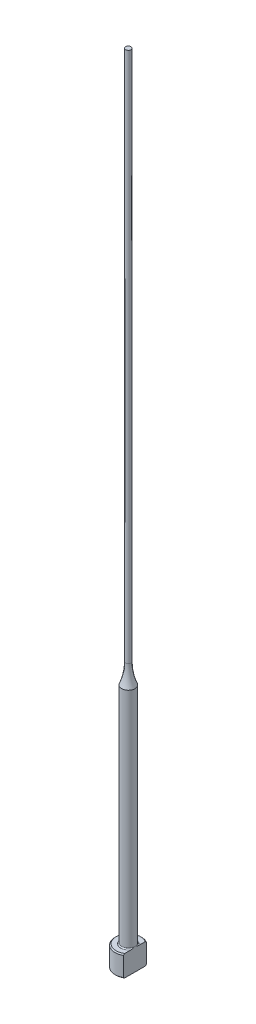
ISO-10303-21;
HEADER;
FILE_DESCRIPTION(('STEP AP214'),'2;1');
FILE_NAME('part.step','',(''),(''),'','','');
FILE_SCHEMA(('AUTOMOTIVE_DESIGN { 1 0 10303 214 1 1 1 1 }'));
ENDSEC;
DATA;
#1=APPLICATION_CONTEXT('core data for automotive mechanical design processes');
#2=APPLICATION_PROTOCOL_DEFINITION('international standard','automotive_design',2000,#1);
#3=PRODUCT_CONTEXT('',#1,'mechanical');
#4=PRODUCT('Part','Part','',(#3));
#5=PRODUCT_RELATED_PRODUCT_CATEGORY('part','',(#4));
#6=PRODUCT_DEFINITION_FORMATION('','',#4);
#7=PRODUCT_DEFINITION_CONTEXT('part definition',#1,'design');
#8=PRODUCT_DEFINITION('design','',#6,#7);
#9=PRODUCT_DEFINITION_SHAPE('','',#8);
#10=(LENGTH_UNIT() NAMED_UNIT(*) SI_UNIT(.MILLI.,.METRE.));
#11=(NAMED_UNIT(*) PLANE_ANGLE_UNIT() SI_UNIT($,.RADIAN.));
#12=(NAMED_UNIT(*) SI_UNIT($,.STERADIAN.) SOLID_ANGLE_UNIT());
#13=UNCERTAINTY_MEASURE_WITH_UNIT(LENGTH_MEASURE(1.E-05),#10,'distance_accuracy_value','');
#14=(GEOMETRIC_REPRESENTATION_CONTEXT(3) GLOBAL_UNCERTAINTY_ASSIGNED_CONTEXT((#13)) GLOBAL_UNIT_ASSIGNED_CONTEXT((#10,
#11,#12)) REPRESENTATION_CONTEXT('',''));
#15=CARTESIAN_POINT('',(0.,0.,0.));
#16=DIRECTION('',(0.,0.,1.));
#17=DIRECTION('',(1.,0.,0.));
#18=AXIS2_PLACEMENT_3D('',#15,#16,#17);
#19=CARTESIAN_POINT('',(-2.49999999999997,4.,0.));
#20=DIRECTION('',(0.,1.,0.));
#21=DIRECTION('',(0.,0.,1.));
#22=AXIS2_PLACEMENT_3D('',#19,#20,#21);
#23=PLANE('',#22);
#24=CARTESIAN_POINT('',(0.,4.,0.));
#25=DIRECTION('',(0.,1.,0.));
#26=DIRECTION('',(0.,0.,1.));
#27=AXIS2_PLACEMENT_3D('',#24,#25,#26);
#28=CIRCLE('',#27,2.29999999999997);
#29=CARTESIAN_POINT('',(1.24999999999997,4.,-1.93067345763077));
#30=VERTEX_POINT('',#29);
#31=CARTESIAN_POINT('',(1.24999999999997,4.,1.93067345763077));
#32=VERTEX_POINT('',#31);
#33=EDGE_CURVE('E187',#30,#32,#28,.T.);
#34=ORIENTED_EDGE('',*,*,#33,.T.);
#35=DIRECTION('',(0.,0.,-1.));
#36=VECTOR('',#35,1.);
#37=CARTESIAN_POINT('',(1.24999999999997,4.,0.));
#38=LINE('',#37,#36);
#39=CARTESIAN_POINT('',(1.24999999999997,3.99999999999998,0.734846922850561));
#40=VERTEX_POINT('',#39);
#41=EDGE_CURVE('E57',#32,#40,#38,.T.);
#42=ORIENTED_EDGE('',*,*,#41,.T.);
#43=CARTESIAN_POINT('',(0.,4.,0.));
#44=DIRECTION('',(0.,1.,0.));
#45=DIRECTION('',(0.,0.,1.));
#46=AXIS2_PLACEMENT_3D('',#43,#44,#45);
#47=CIRCLE('',#46,1.44999999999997);
#48=CARTESIAN_POINT('',(1.24999999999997,3.99999999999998,-0.734846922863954));
#49=VERTEX_POINT('',#48);
#50=EDGE_CURVE('E108',#40,#49,#47,.F.);
#51=ORIENTED_EDGE('',*,*,#50,.T.);
#52=EDGE_CURVE('E137',#49,#30,#38,.T.);
#53=ORIENTED_EDGE('',*,*,#52,.T.);
#54=EDGE_LOOP('',(#34,#42,#51,#53));
#55=FACE_BOUND('',#54,.T.);
#56=ADVANCED_FACE('F32',(#55),#23,.T.);
#57=CARTESIAN_POINT('',(0.,259.958771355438,0.));
#58=DIRECTION('',(0.,1.,0.));
#59=DIRECTION('',(0.,0.,1.));
#60=AXIS2_PLACEMENT_3D('',#57,#58,#59);
#61=CYLINDRICAL_SURFACE('',#60,2.49999999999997);
#62=CARTESIAN_POINT('',(0.,3.80000000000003,0.));
#63=DIRECTION('',(0.,1.,0.));
#64=DIRECTION('',(0.,0.,1.));
#65=AXIS2_PLACEMENT_3D('',#62,#63,#64);
#66=CIRCLE('',#65,2.49999999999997);
#67=CARTESIAN_POINT('',(1.24999999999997,3.80000000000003,2.16506350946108));
#68=VERTEX_POINT('',#67);
#69=CARTESIAN_POINT('',(1.24999999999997,3.80000000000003,-2.16506350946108));
#70=VERTEX_POINT('',#69);
#71=EDGE_CURVE('E105',#68,#70,#66,.F.);
#72=ORIENTED_EDGE('',*,*,#71,.T.);
#73=DIRECTION('',(0.,-1.,0.));
#74=VECTOR('',#73,1.);
#75=CARTESIAN_POINT('',(1.24999999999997,150.,-2.16506350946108));
#76=LINE('',#75,#74);
#77=CARTESIAN_POINT('',(1.24999999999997,0.199999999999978,-2.16506350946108));
#78=VERTEX_POINT('',#77);
#79=EDGE_CURVE('E193',#70,#78,#76,.T.);
#80=ORIENTED_EDGE('',*,*,#79,.T.);
#81=CARTESIAN_POINT('',(0.,0.199999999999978,0.));
#82=DIRECTION('',(0.,-1.,0.));
#83=DIRECTION('',(0.,0.,-1.));
#84=AXIS2_PLACEMENT_3D('',#81,#82,#83);
#85=CIRCLE('',#84,2.49999999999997);
#86=CARTESIAN_POINT('',(1.24999999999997,0.199999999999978,2.16506350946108));
#87=VERTEX_POINT('',#86);
#88=EDGE_CURVE('E100',#78,#87,#85,.F.);
#89=ORIENTED_EDGE('',*,*,#88,.T.);
#90=DIRECTION('',(0.,-1.,0.));
#91=VECTOR('',#90,1.);
#92=CARTESIAN_POINT('',(1.24999999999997,150.,2.16506350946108));
#93=LINE('',#92,#91);
#94=EDGE_CURVE('E93',#68,#87,#93,.T.);
#95=ORIENTED_EDGE('',*,*,#94,.F.);
#96=EDGE_LOOP('',(#72,#80,#89,#95));
#97=FACE_BOUND('',#96,.T.);
#98=ADVANCED_FACE('F158',(#97),#61,.T.);
#99=CARTESIAN_POINT('',(0.,0.,0.));
#100=DIRECTION('',(0.,-1.,0.));
#101=DIRECTION('',(0.,0.,-1.));
#102=AXIS2_PLACEMENT_3D('',#99,#100,#101);
#103=PLANE('',#102);
#104=CARTESIAN_POINT('',(0.,0.,0.));
#105=DIRECTION('',(0.,-1.,0.));
#106=DIRECTION('',(0.,0.,-1.));
#107=AXIS2_PLACEMENT_3D('',#104,#105,#106);
#108=CIRCLE('',#107,2.29999999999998);
#109=CARTESIAN_POINT('',(1.24999999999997,0.,1.93067345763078));
#110=VERTEX_POINT('',#109);
#111=CARTESIAN_POINT('',(1.24999999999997,0.,-1.93067345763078));
#112=VERTEX_POINT('',#111);
#113=EDGE_CURVE('E98',#110,#112,#108,.T.);
#114=ORIENTED_EDGE('',*,*,#113,.T.);
#115=DIRECTION('',(0.,0.,1.));
#116=VECTOR('',#115,1.);
#117=CARTESIAN_POINT('',(1.24999999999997,0.,2.16506350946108));
#118=LINE('',#117,#116);
#119=EDGE_CURVE('E83',#112,#110,#118,.T.);
#120=ORIENTED_EDGE('',*,*,#119,.T.);
#121=EDGE_LOOP('',(#114,#120));
#122=FACE_BOUND('',#121,.T.);
#123=ADVANCED_FACE('F103',(#122),#103,.T.);
#124=CARTESIAN_POINT('',(0.,4.,0.));
#125=DIRECTION('',(0.,-1.,0.));
#126=DIRECTION('',(0.,0.,-1.));
#127=AXIS2_PLACEMENT_3D('',#124,#125,#126);
#128=CONICAL_SURFACE('',#127,2.29999999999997,0.785398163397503);
#129=ORIENTED_EDGE('',*,*,#71,.F.);
#130=CARTESIAN_POINT('',(1.24999999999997,1.37269850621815,4.76610952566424));
#131=CARTESIAN_POINT('',(1.24999999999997,1.47721375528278,4.65805337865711));
#132=CARTESIAN_POINT('',(1.24999999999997,1.5816168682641,4.54988840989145));
#133=CARTESIAN_POINT('',(1.24999999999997,1.79013244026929,4.33327605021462));
#134=CARTESIAN_POINT('',(1.24999999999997,1.89424489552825,4.22482865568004));
#135=CARTESIAN_POINT('',(1.24999999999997,2.10216338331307,4.0075337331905));
#136=CARTESIAN_POINT('',(1.24999999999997,2.20596923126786,3.89868602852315));
#137=CARTESIAN_POINT('',(1.24999999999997,2.4131219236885,3.68055575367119));
#138=CARTESIAN_POINT('',(1.24999999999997,2.51646877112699,3.57127318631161));
#139=CARTESIAN_POINT('',(1.24999999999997,2.72052253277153,3.35432408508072));
#140=CARTESIAN_POINT('',(1.24999999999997,2.82124112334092,3.24666854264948));
#141=CARTESIAN_POINT('',(1.24999999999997,3.02192410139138,3.03065701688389));
#142=CARTESIAN_POINT('',(1.24999999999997,3.12188849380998,2.92230103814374));
#143=CARTESIAN_POINT('',(1.24999999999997,3.32077037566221,2.70467415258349));
#144=CARTESIAN_POINT('',(1.24999999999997,3.41968808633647,2.59540344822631));
#145=CARTESIAN_POINT('',(1.24999999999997,3.61608273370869,2.37557697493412));
#146=CARTESIAN_POINT('',(1.24999999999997,3.71355972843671,2.26502125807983));
#147=CARTESIAN_POINT('',(1.24999999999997,3.86911393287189,2.08515617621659));
#148=CARTESIAN_POINT('',(1.24999999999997,3.9278559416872,2.01642247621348));
#149=CARTESIAN_POINT('',(1.24999999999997,4.04429378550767,1.87806056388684));
#150=CARTESIAN_POINT('',(1.24999999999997,4.1019895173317,1.80843226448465));
#151=CARTESIAN_POINT('',(1.24999999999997,4.21658041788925,1.66728976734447));
#152=CARTESIAN_POINT('',(1.24999999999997,4.27346067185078,1.59576341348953));
#153=CARTESIAN_POINT('',(1.24999999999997,4.38522965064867,1.45118948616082));
#154=CARTESIAN_POINT('',(1.24999999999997,4.44011885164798,1.37814228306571));
#155=CARTESIAN_POINT('',(1.24999999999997,4.54788773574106,1.22886697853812));
#156=CARTESIAN_POINT('',(1.24999999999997,4.60072420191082,1.1526074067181));
#157=CARTESIAN_POINT('',(1.24999999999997,4.70212030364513,0.997098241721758));
#158=CARTESIAN_POINT('',(1.24999999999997,4.75067405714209,0.917844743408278));
#159=CARTESIAN_POINT('',(1.24999999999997,4.84043729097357,0.756494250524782));
#160=CARTESIAN_POINT('',(1.24999999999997,4.88173033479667,0.674444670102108));
#161=CARTESIAN_POINT('',(1.24999999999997,4.95366083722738,0.505835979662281));
#162=CARTESIAN_POINT('',(1.24999999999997,4.98433405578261,0.419293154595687));
#163=CARTESIAN_POINT('',(1.24999999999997,5.01753107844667,0.289507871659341));
#164=CARTESIAN_POINT('',(1.24999999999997,5.02633539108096,0.247870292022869));
#165=CARTESIAN_POINT('',(1.24999999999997,5.03997448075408,0.163937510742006));
#166=CARTESIAN_POINT('',(1.24999999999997,5.04480960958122,0.121642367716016));
#167=CARTESIAN_POINT('',(1.24999999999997,5.05016786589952,0.0369068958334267));
#168=CARTESIAN_POINT('',(1.24999999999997,5.05070431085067,-0.00553257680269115));
#169=CARTESIAN_POINT('',(1.24999999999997,5.04746162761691,-0.0902467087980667));
#170=CARTESIAN_POINT('',(1.24999999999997,5.04368214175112,-0.13252135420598));
#171=CARTESIAN_POINT('',(1.24999999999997,5.03212264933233,-0.216135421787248));
#172=CARTESIAN_POINT('',(1.24999999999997,5.02437758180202,-0.257479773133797));
#173=CARTESIAN_POINT('',(1.24999999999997,5.00536735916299,-0.339354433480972));
#174=CARTESIAN_POINT('',(1.24999999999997,4.99410082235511,-0.379884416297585));
#175=CARTESIAN_POINT('',(1.24999999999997,4.96852211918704,-0.460209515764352));
#176=CARTESIAN_POINT('',(1.24999999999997,4.95419322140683,-0.499999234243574));
#177=CARTESIAN_POINT('',(1.24999999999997,4.92306392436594,-0.578577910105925));
#178=CARTESIAN_POINT('',(1.24999999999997,4.90626403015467,-0.617367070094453));
#179=CARTESIAN_POINT('',(1.24999999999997,4.85269034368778,-0.73271994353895));
#180=CARTESIAN_POINT('',(1.24999999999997,4.81287978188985,-0.807869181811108));
#181=CARTESIAN_POINT('',(1.24999999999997,4.72799210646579,-0.955157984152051));
#182=CARTESIAN_POINT('',(1.24999999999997,4.68290855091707,-1.02729371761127));
#183=CARTESIAN_POINT('',(1.24999999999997,4.58903993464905,-1.16950551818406));
#184=CARTESIAN_POINT('',(1.24999999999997,4.54024093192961,-1.2395723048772));
#185=CARTESIAN_POINT('',(1.24999999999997,4.4402182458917,-1.37788366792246));
#186=CARTESIAN_POINT('',(1.24999999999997,4.38899576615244,-1.44612912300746));
#187=CARTESIAN_POINT('',(1.24999999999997,4.28411092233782,-1.58215279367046));
#188=CARTESIAN_POINT('',(1.24999999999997,4.23042529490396,-1.64991298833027));
#189=CARTESIAN_POINT('',(1.24999999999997,4.12172412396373,-1.78436052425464));
#190=CARTESIAN_POINT('',(1.24999999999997,4.06670849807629,-1.85104779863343));
#191=CARTESIAN_POINT('',(1.24999999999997,3.90044437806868,-2.04954410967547));
#192=CARTESIAN_POINT('',(1.24999999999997,3.78772044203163,-2.18011527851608));
#193=CARTESIAN_POINT('',(1.24999999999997,3.57927088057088,-2.41711311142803));
#194=CARTESIAN_POINT('',(1.24999999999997,3.48391557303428,-2.52386864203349));
#195=CARTESIAN_POINT('',(1.24999999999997,3.29202937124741,-2.73632311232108));
#196=CARTESIAN_POINT('',(1.24999999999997,3.19549844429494,-2.84202202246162));
#197=CARTESIAN_POINT('',(1.24999999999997,2.90446939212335,-3.15815976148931));
#198=CARTESIAN_POINT('',(1.24999999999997,2.70871394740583,-3.36743889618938));
#199=CARTESIAN_POINT('',(1.24999999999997,2.32338273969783,-3.77561196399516));
#200=CARTESIAN_POINT('',(1.24999999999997,2.13388401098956,-3.97457897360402));
#201=CARTESIAN_POINT('',(1.24999999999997,1.84887947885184,-4.27209258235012));
#202=CARTESIAN_POINT('',(1.24999999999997,1.75380504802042,-4.37105278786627));
#203=CARTESIAN_POINT('',(1.24999999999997,1.56341833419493,-4.56874260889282));
#204=CARTESIAN_POINT('',(1.24999999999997,1.46810605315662,-4.66747222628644));
#205=CARTESIAN_POINT('',(1.24999999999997,1.37269850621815,-4.76610952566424));
#206=B_SPLINE_CURVE_WITH_KNOTS('',3,(#130,#131,#132,#133,#134,#135,#136,#137,#138,#139,#140,
#141,#142,#143,#144,#145,#146,#147,#148,#149,#150,#151,#152,#153,#154,#155,#156,#157,#158,#159,
#160,#161,#162,#163,#164,#165,#166,#167,#168,#169,#170,#171,#172,#173,#174,#175,#176,#177,#178,
#179,#180,#181,#182,#183,#184,#185,#186,#187,#188,#189,#190,#191,#192,#193,#194,#195,#196,#197,
#198,#199,#200,#201,#202,#203,#204,#205),.UNSPECIFIED.,.F.,.F.,(4,2,2,2,2,2,2,2,2,2,2,2,2,2,2,2,
2,2,2,2,2,2,2,2,2,2,2,2,2,2,2,2,2,2,2,2,2,4),(0.,0.450994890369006,0.901995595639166,
1.35322763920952,1.80445675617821,2.24672733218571,2.68899501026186,3.13116725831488,
3.5733216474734,3.84456018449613,4.11582532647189,4.3899586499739,4.66402597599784,
4.94225842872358,5.22086725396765,5.49602313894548,5.77024327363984,5.89775644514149,
6.02525831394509,6.15236502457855,6.2794822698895,6.40549833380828,6.5315639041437,
6.6583367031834,6.78508362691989,7.03983854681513,7.29490801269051,7.55098686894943,
7.80693985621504,8.06626716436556,8.32561057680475,8.84304654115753,9.27246240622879,
9.7018902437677,10.5615524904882,11.3858525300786,11.797544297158,12.2092326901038),.UNSPECIFIED.);
#207=EDGE_CURVE('E136',#68,#32,#206,.T.);
#208=ORIENTED_EDGE('',*,*,#207,.T.);
#209=ORIENTED_EDGE('',*,*,#33,.F.);
#210=EDGE_CURVE('E128',#30,#70,#206,.T.);
#211=ORIENTED_EDGE('',*,*,#210,.T.);
#212=EDGE_LOOP('',(#129,#208,#209,#211));
#213=FACE_BOUND('',#212,.T.);
#214=ADVANCED_FACE('F144',(#213),#128,.T.);
#215=CARTESIAN_POINT('',(0.,0.199999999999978,0.));
#216=DIRECTION('',(0.,1.,0.));
#217=DIRECTION('',(0.,0.,1.));
#218=AXIS2_PLACEMENT_3D('',#215,#216,#217);
#219=CONICAL_SURFACE('',#218,2.49999999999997,0.785398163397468);
#220=ORIENTED_EDGE('',*,*,#88,.F.);
#221=CARTESIAN_POINT('',(1.24999999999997,2.62730149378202,-4.76610952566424));
#222=CARTESIAN_POINT('',(1.24999999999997,2.52278624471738,-4.65805337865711));
#223=CARTESIAN_POINT('',(1.24999999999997,2.41838313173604,-4.54988840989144));
#224=CARTESIAN_POINT('',(1.24999999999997,2.20986755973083,-4.3332760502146));
#225=CARTESIAN_POINT('',(1.24999999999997,2.10575510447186,-4.22482865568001));
#226=CARTESIAN_POINT('',(1.24999999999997,1.89783661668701,-4.00753373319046));
#227=CARTESIAN_POINT('',(1.24999999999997,1.79403076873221,-3.89868602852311));
#228=CARTESIAN_POINT('',(1.24999999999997,1.58687807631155,-3.68055575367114));
#229=CARTESIAN_POINT('',(1.24999999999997,1.48353122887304,-3.57127318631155));
#230=CARTESIAN_POINT('',(1.24999999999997,1.27947746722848,-3.35432408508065));
#231=CARTESIAN_POINT('',(1.24999999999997,1.17875887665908,-3.2466685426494));
#232=CARTESIAN_POINT('',(1.24999999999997,0.978075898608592,-3.0306570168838));
#233=CARTESIAN_POINT('',(1.24999999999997,0.878111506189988,-2.92230103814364));
#234=CARTESIAN_POINT('',(1.24999999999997,0.679229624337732,-2.70467415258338));
#235=CARTESIAN_POINT('',(1.24999999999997,0.580311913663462,-2.5954034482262));
#236=CARTESIAN_POINT('',(1.24999999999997,0.383917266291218,-2.375576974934));
#237=CARTESIAN_POINT('',(1.24999999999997,0.286440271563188,-2.2650212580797));
#238=CARTESIAN_POINT('',(1.24999999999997,0.130886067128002,-2.08515617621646));
#239=CARTESIAN_POINT('',(1.24999999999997,0.0721440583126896,-2.01642247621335));
#240=CARTESIAN_POINT('',(1.24999999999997,-0.0442937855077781,-1.87806056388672));
#241=CARTESIAN_POINT('',(1.24999999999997,-0.101989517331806,-1.80843226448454));
#242=CARTESIAN_POINT('',(1.24999999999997,-0.216580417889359,-1.66728976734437));
#243=CARTESIAN_POINT('',(1.24999999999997,-0.273460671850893,-1.59576341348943));
#244=CARTESIAN_POINT('',(1.24999999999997,-0.385229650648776,-1.45118948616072));
#245=CARTESIAN_POINT('',(1.24999999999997,-0.440118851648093,-1.37814228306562));
#246=CARTESIAN_POINT('',(1.24999999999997,-0.547887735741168,-1.22886697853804));
#247=CARTESIAN_POINT('',(1.24999999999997,-0.600724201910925,-1.15260740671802));
#248=CARTESIAN_POINT('',(1.24999999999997,-0.702120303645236,-0.99709824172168));
#249=CARTESIAN_POINT('',(1.24999999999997,-0.750674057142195,-0.917844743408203));
#250=CARTESIAN_POINT('',(1.24999999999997,-0.840437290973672,-0.756494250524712));
#251=CARTESIAN_POINT('',(1.24999999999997,-0.88173033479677,-0.67444467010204));
#252=CARTESIAN_POINT('',(1.24999999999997,-0.953660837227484,-0.505835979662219));
#253=CARTESIAN_POINT('',(1.24999999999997,-0.984334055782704,-0.419293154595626));
#254=CARTESIAN_POINT('',(1.24999999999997,-1.01753107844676,-0.289507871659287));
#255=CARTESIAN_POINT('',(1.24999999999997,-1.02633539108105,-0.247870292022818));
#256=CARTESIAN_POINT('',(1.24999999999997,-1.03997448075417,-0.163937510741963));
#257=CARTESIAN_POINT('',(1.24999999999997,-1.0448096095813,-0.121642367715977));
#258=CARTESIAN_POINT('',(1.24999999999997,-1.05016786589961,-0.0369068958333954));
#259=CARTESIAN_POINT('',(1.24999999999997,-1.05070431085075,0.00553257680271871));
#260=CARTESIAN_POINT('',(1.24999999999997,-1.04746162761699,0.0902467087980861));
#261=CARTESIAN_POINT('',(1.24999999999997,-1.0436821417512,0.132521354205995));
#262=CARTESIAN_POINT('',(1.24999999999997,-1.03212264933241,0.216135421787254));
#263=CARTESIAN_POINT('',(1.24999999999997,-1.0243775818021,0.257479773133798));
#264=CARTESIAN_POINT('',(1.24999999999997,-1.00536735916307,0.339354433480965));
#265=CARTESIAN_POINT('',(1.24999999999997,-0.994100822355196,0.379884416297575));
#266=CARTESIAN_POINT('',(1.24999999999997,-0.96852211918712,0.460209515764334));
#267=CARTESIAN_POINT('',(1.24999999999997,-0.95419322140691,0.499999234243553));
#268=CARTESIAN_POINT('',(1.24999999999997,-0.923063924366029,0.578577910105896));
#269=CARTESIAN_POINT('',(1.24999999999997,-0.906264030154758,0.617367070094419));
#270=CARTESIAN_POINT('',(1.24999999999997,-0.852690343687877,0.7327199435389));
#271=CARTESIAN_POINT('',(1.24999999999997,-0.812879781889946,0.807869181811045));
#272=CARTESIAN_POINT('',(1.24999999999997,-0.727992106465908,0.955157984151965));
#273=CARTESIAN_POINT('',(1.24999999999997,-0.682908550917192,1.02729371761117));
#274=CARTESIAN_POINT('',(1.24999999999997,-0.58903993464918,1.16950551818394));
#275=CARTESIAN_POINT('',(1.24999999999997,-0.540240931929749,1.23957230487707));
#276=CARTESIAN_POINT('',(1.24999999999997,-0.440218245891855,1.3778836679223));
#277=CARTESIAN_POINT('',(1.24999999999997,-0.3889957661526,1.44612912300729));
#278=CARTESIAN_POINT('',(1.24999999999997,-0.284110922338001,1.58215279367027));
#279=CARTESIAN_POINT('',(1.24999999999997,-0.230425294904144,1.64991298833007));
#280=CARTESIAN_POINT('',(1.24999999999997,-0.12172412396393,1.78436052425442));
#281=CARTESIAN_POINT('',(1.24999999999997,-0.0667084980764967,1.8510477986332));
#282=CARTESIAN_POINT('',(1.24999999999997,0.0995556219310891,2.0495441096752));
#283=CARTESIAN_POINT('',(1.24999999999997,0.212279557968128,2.18011527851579));
#284=CARTESIAN_POINT('',(1.24999999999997,0.420729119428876,2.41711311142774));
#285=CARTESIAN_POINT('',(1.24999999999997,0.516084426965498,2.52386864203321));
#286=CARTESIAN_POINT('',(1.24999999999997,0.707970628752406,2.73632311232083));
#287=CARTESIAN_POINT('',(1.24999999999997,0.804501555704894,2.84202202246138));
#288=CARTESIAN_POINT('',(1.24999999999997,1.09553060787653,3.15815976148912));
#289=CARTESIAN_POINT('',(1.24999999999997,1.29128605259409,3.36743889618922));
#290=CARTESIAN_POINT('',(1.24999999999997,1.67661726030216,3.77561196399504));
#291=CARTESIAN_POINT('',(1.24999999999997,1.86611598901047,3.97457897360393));
#292=CARTESIAN_POINT('',(1.24999999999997,2.15112052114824,4.27209258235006));
#293=CARTESIAN_POINT('',(1.24999999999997,2.24619495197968,4.37105278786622));
#294=CARTESIAN_POINT('',(1.24999999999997,2.43658166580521,4.5687426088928));
#295=CARTESIAN_POINT('',(1.24999999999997,2.53189394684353,4.66747222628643));
#296=CARTESIAN_POINT('',(1.24999999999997,2.62730149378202,4.76610952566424));
#297=B_SPLINE_CURVE_WITH_KNOTS('',3,(#221,#222,#223,#224,#225,#226,#227,#228,#229,#230,#231,
#232,#233,#234,#235,#236,#237,#238,#239,#240,#241,#242,#243,#244,#245,#246,#247,#248,#249,#250,
#251,#252,#253,#254,#255,#256,#257,#258,#259,#260,#261,#262,#263,#264,#265,#266,#267,#268,#269,
#270,#271,#272,#273,#274,#275,#276,#277,#278,#279,#280,#281,#282,#283,#284,#285,#286,#287,#288,
#289,#290,#291,#292,#293,#294,#295,#296),.UNSPECIFIED.,.F.,.F.,(4,2,2,2,2,2,2,2,2,2,2,2,2,2,2,2,
2,2,2,2,2,2,2,2,2,2,2,2,2,2,2,2,2,2,2,2,2,4),(0.,0.450994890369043,0.901995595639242,
1.35322763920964,1.80445675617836,2.2467273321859,2.68899501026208,3.13116725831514,
3.57332164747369,3.84456018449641,4.11582532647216,4.38995864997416,4.66402597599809,
4.94225842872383,5.22086725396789,5.49602313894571,5.77024327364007,5.89775644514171,
6.02525831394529,6.15236502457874,6.27948226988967,6.40549833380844,6.53156390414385,
6.65833670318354,6.78508362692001,7.03983854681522,7.29490801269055,7.55098686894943,
7.806939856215,8.06626716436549,8.32561057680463,8.84304654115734,9.27246240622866,
9.70189024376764,10.5615524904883,11.3858525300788,11.7975442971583,12.2092326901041),.UNSPECIFIED.);
#298=EDGE_CURVE('E86',#78,#112,#297,.T.);
#299=ORIENTED_EDGE('',*,*,#298,.T.);
#300=ORIENTED_EDGE('',*,*,#113,.F.);
#301=EDGE_CURVE('E89',#110,#87,#297,.T.);
#302=ORIENTED_EDGE('',*,*,#301,.T.);
#303=EDGE_LOOP('',(#220,#299,#300,#302));
#304=FACE_BOUND('',#303,.T.);
#305=ADVANCED_FACE('F97',(#304),#219,.T.);
#306=CARTESIAN_POINT('',(0.,4.19999999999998,0.));
#307=DIRECTION('',(0.,1.,0.));
#308=DIRECTION('',(0.,0.,1.));
#309=AXIS2_PLACEMENT_3D('',#306,#307,#308);
#310=TOROIDAL_SURFACE('',#309,1.44999999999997,0.2);
#311=CARTESIAN_POINT('',(1.24999999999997,4.19999999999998,0.));
#312=CARTESIAN_POINT('',(1.24999999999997,4.20000051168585,-1.97678914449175E-10));
#313=CARTESIAN_POINT('',(1.24999999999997,4.2000010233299,-1.0890806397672E-07));
#314=CARTESIAN_POINT('',(1.24999999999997,4.2000020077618,-4.52594762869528E-07));
#315=CARTESIAN_POINT('',(1.24999999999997,4.20000247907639,-6.90993038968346E-07));
#316=CARTESIAN_POINT('',(1.24999999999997,4.2000034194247,-1.26357943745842E-06));
#317=CARTESIAN_POINT('',(1.24999999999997,4.20000388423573,-1.6045761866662E-06));
#318=CARTESIAN_POINT('',(1.24999999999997,4.20000476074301,-2.33954900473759E-06));
#319=CARTESIAN_POINT('',(1.24999999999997,4.20000517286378,-2.73304148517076E-06));
#320=CARTESIAN_POINT('',(1.24999999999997,4.20000655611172,-4.1454401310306E-06));
#321=CARTESIAN_POINT('',(1.24999999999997,4.20000745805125,-5.23310092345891E-06));
#322=CARTESIAN_POINT('',(1.24999999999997,4.20000906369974,-7.47950361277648E-06));
#323=CARTESIAN_POINT('',(1.24999999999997,4.20000977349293,-8.63414438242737E-06));
#324=CARTESIAN_POINT('',(1.24999999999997,4.20001244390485,-1.31453477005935E-05));
#325=CARTESIAN_POINT('',(1.24999999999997,4.2000142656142,-1.65880555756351E-05));
#326=CARTESIAN_POINT('',(1.24999999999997,4.20001724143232,-2.33729029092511E-05));
#327=CARTESIAN_POINT('',(1.24999999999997,4.20001844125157,-2.669561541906E-05));
#328=CARTESIAN_POINT('',(1.24999999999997,4.20002354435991,-4.08635086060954E-05));
#329=CARTESIAN_POINT('',(1.24999999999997,4.2000274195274,-5.17114614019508E-05));
#330=CARTESIAN_POINT('',(1.24999999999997,4.2000336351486,-7.20057673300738E-05));
#331=CARTESIAN_POINT('',(1.24999999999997,4.2000361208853,-8.14057065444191E-05));
#332=CARTESIAN_POINT('',(1.24999999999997,4.20005581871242,-0.000149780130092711));
#333=CARTESIAN_POINT('',(1.24999999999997,4.20008094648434,-0.000206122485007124));
#334=CARTESIAN_POINT('',(1.24999999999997,4.2001750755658,-0.000425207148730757));
#335=CARTESIAN_POINT('',(1.24999999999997,4.20023819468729,-0.000589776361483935));
#336=CARTESIAN_POINT('',(1.24999999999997,4.20048692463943,-0.00122878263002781));
#337=CARTESIAN_POINT('',(1.24999999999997,4.20067870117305,-0.00170134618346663));
#338=CARTESIAN_POINT('',(1.24999999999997,4.20146022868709,-0.00363636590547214));
#339=CARTESIAN_POINT('',(1.24999999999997,4.2020429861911,-0.0051009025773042));
#340=CARTESIAN_POINT('',(1.24999999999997,4.20939719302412,-0.0235712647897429));
#341=CARTESIAN_POINT('',(1.24999999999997,4.21621259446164,-0.0405643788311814));
#342=CARTESIAN_POINT('',(1.24999999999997,4.22951000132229,-0.0739606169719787));
#343=CARTESIAN_POINT('',(1.24999999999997,4.23599508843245,-0.0903626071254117));
#344=CARTESIAN_POINT('',(1.24999999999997,4.24961430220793,-0.125111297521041));
#345=CARTESIAN_POINT('',(1.24999999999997,4.25673641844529,-0.14346280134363));
#346=CARTESIAN_POINT('',(1.24999999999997,4.27085039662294,-0.180427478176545));
#347=CARTESIAN_POINT('',(1.24999999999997,4.27784022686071,-0.199041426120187));
#348=CARTESIAN_POINT('',(1.24999999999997,4.29479134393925,-0.245221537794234));
#349=CARTESIAN_POINT('',(1.24999999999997,4.30459026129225,-0.272848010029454));
#350=CARTESIAN_POINT('',(1.24999999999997,4.32310234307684,-0.327738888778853));
#351=CARTESIAN_POINT('',(1.24999999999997,4.3318356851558,-0.354996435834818));
#352=CARTESIAN_POINT('',(1.24999999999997,4.34936561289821,-0.413744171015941));
#353=CARTESIAN_POINT('',(1.24999999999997,4.35799470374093,-0.445285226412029));
#354=CARTESIAN_POINT('',(1.24999999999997,4.37338463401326,-0.50909191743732));
#355=CARTESIAN_POINT('',(1.24999999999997,4.38013036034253,-0.541361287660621));
#356=CARTESIAN_POINT('',(1.24999999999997,4.39136059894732,-0.608339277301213));
#357=CARTESIAN_POINT('',(1.24999999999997,4.39568167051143,-0.643076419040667));
#358=CARTESIAN_POINT('',(1.24999999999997,4.40037605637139,-0.712733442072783));
#359=CARTESIAN_POINT('',(1.24999999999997,4.40076553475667,-0.747651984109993));
#360=CARTESIAN_POINT('',(1.24999999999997,4.39677668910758,-0.808103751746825));
#361=CARTESIAN_POINT('',(1.24999999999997,4.39361441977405,-0.833711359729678));
#362=CARTESIAN_POINT('',(1.24999999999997,4.38355990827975,-0.883915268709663));
#363=CARTESIAN_POINT('',(1.24999999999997,4.37671813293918,-0.908520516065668));
#364=CARTESIAN_POINT('',(1.24999999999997,4.36252570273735,-0.944879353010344));
#365=CARTESIAN_POINT('',(1.24999999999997,4.35688428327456,-0.957298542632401));
#366=CARTESIAN_POINT('',(1.24999999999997,4.34399066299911,-0.981318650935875));
#367=CARTESIAN_POINT('',(1.24999999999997,4.33673636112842,-0.992918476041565));
#368=CARTESIAN_POINT('',(1.24999999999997,4.32199744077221,-1.01267533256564));
#369=CARTESIAN_POINT('',(1.24999999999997,4.31482723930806,-1.02106482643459));
#370=CARTESIAN_POINT('',(1.24999999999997,4.29924321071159,-1.03659690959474));
#371=CARTESIAN_POINT('',(1.24999999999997,4.29083198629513,-1.04374204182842));
#372=CARTESIAN_POINT('',(1.24999999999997,4.27498600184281,-1.05478694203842));
#373=CARTESIAN_POINT('',(1.24999999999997,4.26780814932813,-1.059053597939));
#374=CARTESIAN_POINT('',(1.24999999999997,4.25284782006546,-1.06635953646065));
#375=CARTESIAN_POINT('',(1.24999999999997,4.24506572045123,-1.06939957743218));
#376=CARTESIAN_POINT('',(1.24999999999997,4.22901828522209,-1.07404931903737));
#377=CARTESIAN_POINT('',(1.24999999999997,4.22074990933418,-1.07564870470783));
#378=CARTESIAN_POINT('',(1.24999999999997,4.20405985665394,-1.07723717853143));
#379=CARTESIAN_POINT('',(1.24999999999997,4.19563825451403,-1.07722703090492));
#380=CARTESIAN_POINT('',(1.24999999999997,4.17988128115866,-1.07569157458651));
#381=CARTESIAN_POINT('',(1.24999999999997,4.17252879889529,-1.0743339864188));
#382=CARTESIAN_POINT('',(1.24999999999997,4.15814333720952,-1.07044616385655));
#383=CARTESIAN_POINT('',(1.24999999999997,4.15111040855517,-1.06791574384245));
#384=CARTESIAN_POINT('',(1.24999999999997,4.13724955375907,-1.06171920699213));
#385=CARTESIAN_POINT('',(1.24999999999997,4.13043935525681,-1.05801386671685));
#386=CARTESIAN_POINT('',(1.24999999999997,4.11740316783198,-1.04969609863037));
#387=CARTESIAN_POINT('',(1.24999999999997,4.11117742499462,-1.04508329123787));
#388=CARTESIAN_POINT('',(1.24999999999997,4.09586196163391,-1.03220341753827));
#389=CARTESIAN_POINT('',(1.24999999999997,4.08723799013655,-1.02338140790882));
#390=CARTESIAN_POINT('',(1.24999999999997,4.07148817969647,-1.00448021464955));
#391=CARTESIAN_POINT('',(1.24999999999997,4.0643671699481,-0.994397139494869));
#392=CARTESIAN_POINT('',(1.24999999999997,4.04800089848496,-0.967694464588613));
#393=CARTESIAN_POINT('',(1.24999999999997,4.0397014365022,-0.950498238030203));
#394=CARTESIAN_POINT('',(1.24999999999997,4.02582422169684,-0.915117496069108));
#395=CARTESIAN_POINT('',(1.24999999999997,4.02024415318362,-0.896933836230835));
#396=CARTESIAN_POINT('',(1.24999999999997,4.00805724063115,-0.84678106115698));
#397=CARTESIAN_POINT('',(1.24999999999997,4.00359525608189,-0.814297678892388));
#398=CARTESIAN_POINT('',(1.24999999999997,3.99933348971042,-0.748574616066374));
#399=CARTESIAN_POINT('',(1.24999999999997,3.99961552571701,-0.715331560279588));
#400=CARTESIAN_POINT('',(1.24999999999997,4.00446632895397,-0.637920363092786));
#401=CARTESIAN_POINT('',(1.24999999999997,4.0104488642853,-0.593849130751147));
#402=CARTESIAN_POINT('',(1.24999999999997,4.02681929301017,-0.506401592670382));
#403=CARTESIAN_POINT('',(1.24999999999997,4.03722697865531,-0.463029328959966));
#404=CARTESIAN_POINT('',(1.24999999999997,4.06007158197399,-0.380638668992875));
#405=CARTESIAN_POINT('',(1.24999999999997,4.07227412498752,-0.341553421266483));
#406=CARTESIAN_POINT('',(1.24999999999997,4.09824323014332,-0.264347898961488));
#407=CARTESIAN_POINT('',(1.24999999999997,4.11199311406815,-0.226221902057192));
#408=CARTESIAN_POINT('',(1.24999999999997,4.13108825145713,-0.17535053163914));
#409=CARTESIAN_POINT('',(1.24999999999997,4.13599999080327,-0.162438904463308));
#410=CARTESIAN_POINT('',(1.24999999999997,4.14604281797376,-0.13631825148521));
#411=CARTESIAN_POINT('',(1.24999999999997,4.15117629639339,-0.123110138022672));
#412=CARTESIAN_POINT('',(1.24999999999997,4.16341702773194,-0.0918425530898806));
#413=CARTESIAN_POINT('',(1.24999999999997,4.17055250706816,-0.0737943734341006));
#414=CARTESIAN_POINT('',(1.24999999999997,4.18426943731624,-0.039358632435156));
#415=CARTESIAN_POINT('',(1.24999999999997,4.19084281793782,-0.0229681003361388));
#416=CARTESIAN_POINT('',(1.24999999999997,4.1979556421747,-0.00510438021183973));
#417=CARTESIAN_POINT('',(1.24999999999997,4.19853702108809,-0.00364331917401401));
#418=CARTESIAN_POINT('',(1.24999999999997,4.19931818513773,-0.00170914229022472));
#419=CARTESIAN_POINT('',(1.24999999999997,4.19951102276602,-0.00123396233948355));
#420=CARTESIAN_POINT('',(1.24999999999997,4.19976104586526,-0.000591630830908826));
#421=CARTESIAN_POINT('',(1.24999999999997,4.19982443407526,-0.000426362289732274));
#422=CARTESIAN_POINT('',(1.24999999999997,4.19991892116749,-0.000206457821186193));
#423=CARTESIAN_POINT('',(1.24999999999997,4.19994410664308,-0.000149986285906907));
#424=CARTESIAN_POINT('',(1.24999999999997,4.19996383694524,-8.1464748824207E-05));
#425=CARTESIAN_POINT('',(1.24999999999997,4.1999663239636,-7.20551568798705E-05));
#426=CARTESIAN_POINT('',(1.24999999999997,4.19997254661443,-5.17396177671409E-05));
#427=CARTESIAN_POINT('',(1.24999999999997,4.19997642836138,-4.08803464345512E-05));
#428=CARTESIAN_POINT('',(1.24999999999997,4.19998153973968,-2.6699757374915E-05));
#429=CARTESIAN_POINT('',(1.24999999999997,4.19998274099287,-2.33755458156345E-05));
#430=CARTESIAN_POINT('',(1.24999999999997,4.19998572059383,-1.65878758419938E-05));
#431=CARTESIAN_POINT('',(1.24999999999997,4.1999875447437,-1.31438994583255E-05));
#432=CARTESIAN_POINT('',(1.24999999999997,4.19999021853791,-8.63150514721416E-06));
#433=CARTESIAN_POINT('',(1.24999999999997,4.19999092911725,-7.47674883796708E-06));
#434=CARTESIAN_POINT('',(1.24999999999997,4.19999253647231,-5.2302708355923E-06));
#435=CARTESIAN_POINT('',(1.24999999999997,4.19999343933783,-4.14265823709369E-06));
#436=CARTESIAN_POINT('',(1.24999999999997,4.19999482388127,-2.73051192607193E-06));
#437=CARTESIAN_POINT('',(1.24999999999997,4.19999523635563,-2.3371292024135E-06));
#438=CARTESIAN_POINT('',(1.24999999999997,4.19999611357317,-1.60243919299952E-06));
#439=CARTESIAN_POINT('',(1.24999999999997,4.199996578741,-1.26161621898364E-06));
#440=CARTESIAN_POINT('',(1.24999999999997,4.19999751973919,-6.89449600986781E-07));
#441=CARTESIAN_POINT('',(1.24999999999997,4.19999799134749,-4.51288705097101E-07));
#442=CARTESIAN_POINT('',(1.24999999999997,4.19999897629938,-1.08178112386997E-07));
#443=CARTESIAN_POINT('',(1.24999999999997,4.1999994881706,1.97734354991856E-10));
#444=CARTESIAN_POINT('',(1.24999999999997,4.19999999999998,0.));
#445=B_SPLINE_CURVE_WITH_KNOTS('',3,(#311,#312,#313,#314,#315,#316,#317,#318,#319,#320,#321,
#322,#323,#324,#325,#326,#327,#328,#329,#330,#331,#332,#333,#334,#335,#336,#337,#338,#339,#340,
#341,#342,#343,#344,#345,#346,#347,#348,#349,#350,#351,#352,#353,#354,#355,#356,#357,#358,#359,
#360,#361,#362,#363,#364,#365,#366,#367,#368,#369,#370,#371,#372,#373,#374,#375,#376,#377,#378,
#379,#380,#381,#382,#383,#384,#385,#386,#387,#388,#389,#390,#391,#392,#393,#394,#395,#396,#397,
#398,#399,#400,#401,#402,#403,#404,#405,#406,#407,#408,#409,#410,#411,#412,#413,#414,#415,#416,
#417,#418,#419,#420,#421,#422,#423,#424,#425,#426,#427,#428,#429,#430,#431,#432,#433,#434,#435,
#436,#437,#438,#439,#440,#441,#442,#443,#444),.UNSPECIFIED.,.T.,.F.,(4,2,2,2,2,2,2,2,2,2,2,2,2,
2,2,2,2,2,2,2,2,2,2,2,2,2,2,2,2,2,2,2,2,2,2,2,2,2,2,2,2,2,2,2,2,2,2,2,2,2,2,2,2,2,2,2,2,2,2,2,2,
2,2,2,2,2,4),(0.,1.5342757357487E-06,3.1111505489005E-06,4.83351634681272E-06,
6.54098944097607E-06,1.07594293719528E-05,1.48222851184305E-05,2.64707313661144E-05,
3.70576287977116E-05,7.16088726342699E-05,0.000100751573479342,0.000285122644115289,
0.000814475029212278,0.00234373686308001,0.00707317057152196,0.0619940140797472,
0.114907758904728,0.173961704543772,0.233609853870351,0.321537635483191,0.407388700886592,
0.505443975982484,0.604264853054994,0.709126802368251,0.813557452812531,0.8907731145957,
0.966955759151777,1.0077884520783,1.04867465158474,1.08167318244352,1.11460346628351,
1.13955805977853,1.16449720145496,1.18961351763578,1.21471790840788,1.23704542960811,
1.25937648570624,1.28254952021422,1.30573226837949,1.34253218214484,1.3794485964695,
1.43640829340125,1.49331940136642,1.591136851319,1.69064301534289,1.82371118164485,
1.95738088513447,2.08016146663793,2.20172662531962,2.24316968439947,2.28568093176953,
2.34390494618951,2.39687801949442,2.4015962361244,2.40313396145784,2.40366556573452,
2.40385035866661,2.40387953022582,2.40391411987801,2.40392471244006,2.40393636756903,
2.40394043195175,2.4039446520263,2.40394636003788,2.40394808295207,2.40394966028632,
2.40395119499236),.UNSPECIFIED.);
#446=CARTESIAN_POINT('',(1.24999999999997,4.19999999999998,0.));
#447=VERTEX_POINT('',#446);
#448=EDGE_CURVE('E11',#49,#447,#445,.T.);
#449=ORIENTED_EDGE('',*,*,#448,.F.);
#450=ORIENTED_EDGE('',*,*,#50,.F.);
#451=CARTESIAN_POINT('',(1.24999999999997,4.19999999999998,0.));
#452=CARTESIAN_POINT('',(1.24999999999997,4.19999948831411,1.97678915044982E-10));
#453=CARTESIAN_POINT('',(1.24999999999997,4.19999897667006,1.08908063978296E-07));
#454=CARTESIAN_POINT('',(1.24999999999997,4.19999799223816,4.52594762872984E-07));
#455=CARTESIAN_POINT('',(1.24999999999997,4.19999752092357,6.9099303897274E-07));
#456=CARTESIAN_POINT('',(1.24999999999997,4.19999658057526,1.26357943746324E-06));
#457=CARTESIAN_POINT('',(1.24999999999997,4.19999611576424,1.60457618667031E-06));
#458=CARTESIAN_POINT('',(1.24999999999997,4.19999523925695,2.33954900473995E-06));
#459=CARTESIAN_POINT('',(1.24999999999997,4.19999482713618,2.73304148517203E-06));
#460=CARTESIAN_POINT('',(1.24999999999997,4.19999344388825,4.14544013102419E-06));
#461=CARTESIAN_POINT('',(1.24999999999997,4.19999254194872,5.23310092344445E-06));
#462=CARTESIAN_POINT('',(1.24999999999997,4.19999093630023,7.47950361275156E-06));
#463=CARTESIAN_POINT('',(1.24999999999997,4.19999022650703,8.63414438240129E-06));
#464=CARTESIAN_POINT('',(1.24999999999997,4.19998755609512,1.31453477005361E-05));
#465=CARTESIAN_POINT('',(1.24999999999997,4.19998573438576,1.65880555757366E-05));
#466=CARTESIAN_POINT('',(1.24999999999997,4.19998275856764,2.33729029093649E-05));
#467=CARTESIAN_POINT('',(1.24999999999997,4.19998155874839,2.66956154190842E-05));
#468=CARTESIAN_POINT('',(1.24999999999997,4.19997645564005,4.08635086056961E-05));
#469=CARTESIAN_POINT('',(1.24999999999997,4.19997258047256,5.17114614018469E-05));
#470=CARTESIAN_POINT('',(1.24999999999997,4.19996636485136,7.20057673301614E-05));
#471=CARTESIAN_POINT('',(1.24999999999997,4.19996387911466,8.1405706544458E-05));
#472=CARTESIAN_POINT('',(1.24999999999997,4.19994418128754,0.000149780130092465));
#473=CARTESIAN_POINT('',(1.24999999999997,4.19991905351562,0.000206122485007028));
#474=CARTESIAN_POINT('',(1.24999999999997,4.19982492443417,0.000425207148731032));
#475=CARTESIAN_POINT('',(1.24999999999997,4.19976180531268,0.000589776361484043));
#476=CARTESIAN_POINT('',(1.24999999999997,4.19951307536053,0.0012287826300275));
#477=CARTESIAN_POINT('',(1.24999999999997,4.19932129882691,0.0017013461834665));
#478=CARTESIAN_POINT('',(1.24999999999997,4.19853977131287,0.00363636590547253));
#479=CARTESIAN_POINT('',(1.24999999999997,4.19795701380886,0.00510090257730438));
#480=CARTESIAN_POINT('',(1.24999999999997,4.19060280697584,0.0235712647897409));
#481=CARTESIAN_POINT('',(1.24999999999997,4.18378740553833,0.0405643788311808));
#482=CARTESIAN_POINT('',(1.24999999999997,4.17048999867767,0.0739606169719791));
#483=CARTESIAN_POINT('',(1.24999999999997,4.16400491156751,0.0903626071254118));
#484=CARTESIAN_POINT('',(1.24999999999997,4.15038569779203,0.125111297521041));
#485=CARTESIAN_POINT('',(1.24999999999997,4.14326358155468,0.14346280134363));
#486=CARTESIAN_POINT('',(1.24999999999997,4.12914960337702,0.180427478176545));
#487=CARTESIAN_POINT('',(1.24999999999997,4.12215977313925,0.199041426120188));
#488=CARTESIAN_POINT('',(1.24999999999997,4.10520865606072,0.245221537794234));
#489=CARTESIAN_POINT('',(1.24999999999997,4.09540973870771,0.272848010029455));
#490=CARTESIAN_POINT('',(1.24999999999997,4.07689765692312,0.327738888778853));
#491=CARTESIAN_POINT('',(1.24999999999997,4.06816431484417,0.354996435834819));
#492=CARTESIAN_POINT('',(1.24999999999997,4.05063438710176,0.413744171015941));
#493=CARTESIAN_POINT('',(1.24999999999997,4.04200529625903,0.445285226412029));
#494=CARTESIAN_POINT('',(1.24999999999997,4.0266153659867,0.50909191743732));
#495=CARTESIAN_POINT('',(1.24999999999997,4.01986963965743,0.541361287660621));
#496=CARTESIAN_POINT('',(1.24999999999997,4.00863940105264,0.608339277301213));
#497=CARTESIAN_POINT('',(1.24999999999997,4.00431832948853,0.643076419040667));
#498=CARTESIAN_POINT('',(1.24999999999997,3.99962394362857,0.712733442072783));
#499=CARTESIAN_POINT('',(1.24999999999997,3.99923446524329,0.747651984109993));
#500=CARTESIAN_POINT('',(1.24999999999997,4.00322331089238,0.808103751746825));
#501=CARTESIAN_POINT('',(1.24999999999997,4.00638558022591,0.833711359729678));
#502=CARTESIAN_POINT('',(1.24999999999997,4.01644009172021,0.883915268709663));
#503=CARTESIAN_POINT('',(1.24999999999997,4.02328186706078,0.908520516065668));
#504=CARTESIAN_POINT('',(1.24999999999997,4.03747429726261,0.944879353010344));
#505=CARTESIAN_POINT('',(1.24999999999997,4.0431157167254,0.957298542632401));
#506=CARTESIAN_POINT('',(1.24999999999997,4.05600933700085,0.981318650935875));
#507=CARTESIAN_POINT('',(1.24999999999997,4.06326363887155,0.992918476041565));
#508=CARTESIAN_POINT('',(1.24999999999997,4.07800255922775,1.01267533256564));
#509=CARTESIAN_POINT('',(1.24999999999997,4.08517276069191,1.02106482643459));
#510=CARTESIAN_POINT('',(1.24999999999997,4.10075678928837,1.03659690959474));
#511=CARTESIAN_POINT('',(1.24999999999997,4.10916801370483,1.04374204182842));
#512=CARTESIAN_POINT('',(1.24999999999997,4.12501399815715,1.05478694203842));
#513=CARTESIAN_POINT('',(1.24999999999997,4.13219185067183,1.059053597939));
#514=CARTESIAN_POINT('',(1.24999999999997,4.1471521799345,1.06635953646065));
#515=CARTESIAN_POINT('',(1.24999999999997,4.15493427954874,1.06939957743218));
#516=CARTESIAN_POINT('',(1.24999999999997,4.17098171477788,1.07404931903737));
#517=CARTESIAN_POINT('',(1.24999999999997,4.17925009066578,1.07564870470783));
#518=CARTESIAN_POINT('',(1.24999999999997,4.19594014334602,1.07723717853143));
#519=CARTESIAN_POINT('',(1.24999999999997,4.20436174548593,1.07722703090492));
#520=CARTESIAN_POINT('',(1.24999999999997,4.2201187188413,1.07569157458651));
#521=CARTESIAN_POINT('',(1.24999999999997,4.22747120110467,1.0743339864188));
#522=CARTESIAN_POINT('',(1.24999999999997,4.24185666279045,1.07044616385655));
#523=CARTESIAN_POINT('',(1.24999999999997,4.24888959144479,1.06791574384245));
#524=CARTESIAN_POINT('',(1.24999999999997,4.26275044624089,1.06171920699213));
#525=CARTESIAN_POINT('',(1.24999999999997,4.26956064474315,1.05801386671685));
#526=CARTESIAN_POINT('',(1.24999999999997,4.28259683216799,1.04969609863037));
#527=CARTESIAN_POINT('',(1.24999999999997,4.28882257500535,1.04508329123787));
#528=CARTESIAN_POINT('',(1.24999999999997,4.30413803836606,1.03220341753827));
#529=CARTESIAN_POINT('',(1.24999999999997,4.31276200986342,1.02338140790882));
#530=CARTESIAN_POINT('',(1.24999999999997,4.32851182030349,1.00448021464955));
#531=CARTESIAN_POINT('',(1.24999999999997,4.33563283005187,0.994397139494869));
#532=CARTESIAN_POINT('',(1.24999999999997,4.351999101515,0.967694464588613));
#533=CARTESIAN_POINT('',(1.24999999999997,4.36029856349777,0.950498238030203));
#534=CARTESIAN_POINT('',(1.24999999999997,4.37417577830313,0.915117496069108));
#535=CARTESIAN_POINT('',(1.24999999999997,4.37975584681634,0.896933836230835));
#536=CARTESIAN_POINT('',(1.24999999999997,4.39194275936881,0.84678106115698));
#537=CARTESIAN_POINT('',(1.24999999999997,4.39640474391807,0.814297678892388));
#538=CARTESIAN_POINT('',(1.24999999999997,4.40066651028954,0.748574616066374));
#539=CARTESIAN_POINT('',(1.24999999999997,4.40038447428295,0.715331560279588));
#540=CARTESIAN_POINT('',(1.24999999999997,4.395533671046,0.637920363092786));
#541=CARTESIAN_POINT('',(1.24999999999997,4.38955113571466,0.593849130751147));
#542=CARTESIAN_POINT('',(1.24999999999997,4.37318070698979,0.506401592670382));
#543=CARTESIAN_POINT('',(1.24999999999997,4.36277302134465,0.463029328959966));
#544=CARTESIAN_POINT('',(1.24999999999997,4.33992841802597,0.380638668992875));
#545=CARTESIAN_POINT('',(1.24999999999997,4.32772587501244,0.341553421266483));
#546=CARTESIAN_POINT('',(1.24999999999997,4.30175676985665,0.264347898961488));
#547=CARTESIAN_POINT('',(1.24999999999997,4.28800688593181,0.226221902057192));
#548=CARTESIAN_POINT('',(1.24999999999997,4.26891174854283,0.17535053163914));
#549=CARTESIAN_POINT('',(1.24999999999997,4.2640000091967,0.162438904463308));
#550=CARTESIAN_POINT('',(1.24999999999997,4.25395718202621,0.13631825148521));
#551=CARTESIAN_POINT('',(1.24999999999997,4.24882370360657,0.123110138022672));
#552=CARTESIAN_POINT('',(1.24999999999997,4.23658297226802,0.0918425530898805));
#553=CARTESIAN_POINT('',(1.24999999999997,4.2294474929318,0.0737943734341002));
#554=CARTESIAN_POINT('',(1.24999999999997,4.21573056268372,0.0393586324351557));
#555=CARTESIAN_POINT('',(1.24999999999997,4.20915718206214,0.0229681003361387));
#556=CARTESIAN_POINT('',(1.24999999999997,4.20204435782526,0.00510438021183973));
#557=CARTESIAN_POINT('',(1.24999999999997,4.20146297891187,0.00364331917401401));
#558=CARTESIAN_POINT('',(1.24999999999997,4.20068181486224,0.00170914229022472));
#559=CARTESIAN_POINT('',(1.24999999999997,4.20048897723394,0.00123396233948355));
#560=CARTESIAN_POINT('',(1.24999999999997,4.2002389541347,0.000591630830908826));
#561=CARTESIAN_POINT('',(1.24999999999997,4.2001755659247,0.000426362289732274));
#562=CARTESIAN_POINT('',(1.24999999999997,4.20008107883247,0.000206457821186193));
#563=CARTESIAN_POINT('',(1.24999999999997,4.20005589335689,0.000149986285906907));
#564=CARTESIAN_POINT('',(1.24999999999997,4.20003616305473,8.1464748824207E-05));
#565=CARTESIAN_POINT('',(1.24999999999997,4.20003367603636,7.20551568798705E-05));
#566=CARTESIAN_POINT('',(1.24999999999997,4.20002745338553,5.17396177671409E-05));
#567=CARTESIAN_POINT('',(1.24999999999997,4.20002357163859,4.08803464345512E-05));
#568=CARTESIAN_POINT('',(1.24999999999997,4.20001846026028,2.6699757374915E-05));
#569=CARTESIAN_POINT('',(1.24999999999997,4.2000172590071,2.33755458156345E-05));
#570=CARTESIAN_POINT('',(1.24999999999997,4.20001427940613,1.65878758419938E-05));
#571=CARTESIAN_POINT('',(1.24999999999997,4.20001245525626,1.31438994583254E-05));
#572=CARTESIAN_POINT('',(1.24999999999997,4.20000978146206,8.63150514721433E-06));
#573=CARTESIAN_POINT('',(1.24999999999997,4.20000907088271,7.47674883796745E-06));
#574=CARTESIAN_POINT('',(1.24999999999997,4.20000746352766,5.23027083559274E-06));
#575=CARTESIAN_POINT('',(1.24999999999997,4.20000656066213,4.14265823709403E-06));
#576=CARTESIAN_POINT('',(1.24999999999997,4.20000517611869,2.73051192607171E-06));
#577=CARTESIAN_POINT('',(1.24999999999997,4.20000476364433,2.33712920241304E-06));
#578=CARTESIAN_POINT('',(1.24999999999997,4.20000388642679,1.60243919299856E-06));
#579=CARTESIAN_POINT('',(1.24999999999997,4.20000342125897,1.26161621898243E-06));
#580=CARTESIAN_POINT('',(1.24999999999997,4.20000248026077,6.89449600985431E-07));
#581=CARTESIAN_POINT('',(1.24999999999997,4.20000200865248,4.51288705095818E-07));
#582=CARTESIAN_POINT('',(1.24999999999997,4.20000102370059,1.08178112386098E-07));
#583=CARTESIAN_POINT('',(1.24999999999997,4.20000051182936,-1.97734355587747E-10));
#584=CARTESIAN_POINT('',(1.24999999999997,4.19999999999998,0.));
#585=B_SPLINE_CURVE_WITH_KNOTS('',3,(#451,#452,#453,#454,#455,#456,#457,#458,#459,#460,#461,
#462,#463,#464,#465,#466,#467,#468,#469,#470,#471,#472,#473,#474,#475,#476,#477,#478,#479,#480,
#481,#482,#483,#484,#485,#486,#487,#488,#489,#490,#491,#492,#493,#494,#495,#496,#497,#498,#499,
#500,#501,#502,#503,#504,#505,#506,#507,#508,#509,#510,#511,#512,#513,#514,#515,#516,#517,#518,
#519,#520,#521,#522,#523,#524,#525,#526,#527,#528,#529,#530,#531,#532,#533,#534,#535,#536,#537,
#538,#539,#540,#541,#542,#543,#544,#545,#546,#547,#548,#549,#550,#551,#552,#553,#554,#555,#556,
#557,#558,#559,#560,#561,#562,#563,#564,#565,#566,#567,#568,#569,#570,#571,#572,#573,#574,#575,
#576,#577,#578,#579,#580,#581,#582,#583,#584),.UNSPECIFIED.,.T.,.F.,(4,2,2,2,2,2,2,2,2,2,2,2,2,
2,2,2,2,2,2,2,2,2,2,2,2,2,2,2,2,2,2,2,2,2,2,2,2,2,2,2,2,2,2,2,2,2,2,2,2,2,2,2,2,2,2,2,2,2,2,2,2,
2,2,2,2,2,4),(0.,1.53427573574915E-06,3.11115054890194E-06,4.83351634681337E-06,
6.5409894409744E-06,1.07594293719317E-05,1.48222851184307E-05,2.64707313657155E-05,
3.70576287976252E-05,7.16088726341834E-05,0.000100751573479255,0.000285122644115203,
0.000814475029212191,0.00234373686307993,0.00707317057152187,0.0619940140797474,
0.114907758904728,0.173961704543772,0.23360985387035,0.321537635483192,0.407388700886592,
0.505443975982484,0.604264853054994,0.709126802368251,0.813557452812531,0.890773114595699,
0.966955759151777,1.0077884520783,1.04867465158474,1.08167318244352,1.11460346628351,
1.13955805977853,1.16449720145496,1.18961351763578,1.21471790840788,1.23704542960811,
1.25937648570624,1.28254952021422,1.30573226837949,1.34253218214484,1.3794485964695,
1.43640829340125,1.49331940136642,1.591136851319,1.69064301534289,1.82371118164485,
1.95738088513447,2.08016146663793,2.20172662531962,2.24316968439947,2.28568093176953,
2.34390494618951,2.39687801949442,2.4015962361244,2.40313396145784,2.40366556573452,
2.40385035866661,2.40387953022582,2.40391411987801,2.40392471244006,2.40393636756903,
2.40394043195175,2.4039446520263,2.40394636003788,2.40394808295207,2.40394966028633,
2.40395119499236),.UNSPECIFIED.);
#586=EDGE_CURVE('E46',#447,#40,#585,.T.);
#587=ORIENTED_EDGE('',*,*,#586,.F.);
#588=CARTESIAN_POINT('',(0.,4.19999999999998,0.));
#589=DIRECTION('',(0.,1.,0.));
#590=DIRECTION('',(0.,0.,1.));
#591=AXIS2_PLACEMENT_3D('',#588,#589,#590);
#592=CIRCLE('',#591,1.24999999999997);
#593=EDGE_CURVE('E104',#447,#447,#592,.T.);
#594=ORIENTED_EDGE('',*,*,#593,.F.);
#595=EDGE_LOOP('',(#449,#450,#587,#594));
#596=FACE_BOUND('',#595,.T.);
#597=ADVANCED_FACE('F34',(#596),#310,.F.);
#598=CARTESIAN_POINT('',(-0.499999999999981,150.,0.));
#599=DIRECTION('',(0.,1.,0.));
#600=DIRECTION('',(0.,0.,1.));
#601=AXIS2_PLACEMENT_3D('',#598,#599,#600);
#602=PLANE('',#601);
#603=CARTESIAN_POINT('',(0.,150.,0.));
#604=DIRECTION('',(0.,1.,0.));
#605=DIRECTION('',(0.,0.,1.));
#606=AXIS2_PLACEMENT_3D('',#603,#604,#605);
#607=CIRCLE('',#606,0.499999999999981);
#608=CARTESIAN_POINT('',(0.,150.,0.499999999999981));
#609=VERTEX_POINT('',#608);
#610=EDGE_CURVE('E186',#609,#609,#607,.T.);
#611=ORIENTED_EDGE('',*,*,#610,.T.);
#612=EDGE_LOOP('',(#611));
#613=FACE_BOUND('',#612,.T.);
#614=ADVANCED_FACE('F149',(#613),#602,.T.);
#615=CARTESIAN_POINT('',(0.,259.958771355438,0.));
#616=DIRECTION('',(0.,1.,0.));
#617=DIRECTION('',(0.,0.,1.));
#618=AXIS2_PLACEMENT_3D('',#615,#616,#617);
#619=CYLINDRICAL_SURFACE('',#618,0.49999999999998);
#620=CARTESIAN_POINT('',(0.,50.,0.));
#621=DIRECTION('',(0.,1.,0.));
#622=DIRECTION('',(0.,0.,1.));
#623=AXIS2_PLACEMENT_3D('',#620,#621,#622);
#624=CIRCLE('',#623,0.49999999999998);
#625=CARTESIAN_POINT('',(0.,50.,0.49999999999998));
#626=VERTEX_POINT('',#625);
#627=EDGE_CURVE('E183',#626,#626,#624,.T.);
#628=ORIENTED_EDGE('',*,*,#627,.T.);
#629=EDGE_LOOP('',(#628));
#630=FACE_BOUND('',#629,.T.);
#631=ORIENTED_EDGE('',*,*,#610,.F.);
#632=EDGE_LOOP('',(#631));
#633=FACE_BOUND('',#632,.T.);
#634=ADVANCED_FACE('F172',(#630,#633),#619,.T.);
#635=CARTESIAN_POINT('',(0.,50.,0.));
#636=DIRECTION('',(0.,1.,0.));
#637=DIRECTION('',(0.,0.,1.));
#638=AXIS2_PLACEMENT_3D('',#635,#636,#637);
#639=TOROIDAL_SURFACE('',#638,10.5,10.);
#640=CARTESIAN_POINT('',(0.,46.2003289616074,0.));
#641=DIRECTION('',(0.,1.,0.));
#642=DIRECTION('',(0.,0.,1.));
#643=AXIS2_PLACEMENT_3D('',#640,#641,#642);
#644=CIRCLE('',#643,1.24999999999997);
#645=CARTESIAN_POINT('',(0.,46.2003289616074,1.24999999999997));
#646=VERTEX_POINT('',#645);
#647=EDGE_CURVE('E101',#646,#646,#644,.T.);
#648=ORIENTED_EDGE('',*,*,#647,.T.);
#649=EDGE_LOOP('',(#648));
#650=FACE_BOUND('',#649,.T.);
#651=ORIENTED_EDGE('',*,*,#627,.F.);
#652=EDGE_LOOP('',(#651));
#653=FACE_BOUND('',#652,.T.);
#654=ADVANCED_FACE('F169',(#650,#653),#639,.F.);
#655=CARTESIAN_POINT('',(0.,259.958771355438,0.));
#656=DIRECTION('',(0.,1.,0.));
#657=DIRECTION('',(0.,0.,1.));
#658=AXIS2_PLACEMENT_3D('',#655,#656,#657);
#659=CYLINDRICAL_SURFACE('',#658,1.24999999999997);
#660=ORIENTED_EDGE('',*,*,#593,.T.);
#661=EDGE_LOOP('',(#660));
#662=FACE_BOUND('',#661,.T.);
#663=ORIENTED_EDGE('',*,*,#647,.F.);
#664=EDGE_LOOP('',(#663));
#665=FACE_BOUND('',#664,.T.);
#666=ADVANCED_FACE('F122',(#662,#665),#659,.T.);
#667=CARTESIAN_POINT('',(1.24999999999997,150.,2.16506350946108));
#668=DIRECTION('',(1.,0.,0.));
#669=DIRECTION('',(0.,0.,-1.));
#670=AXIS2_PLACEMENT_3D('',#667,#668,#669);
#671=PLANE('',#670);
#672=ORIENTED_EDGE('',*,*,#79,.F.);
#673=ORIENTED_EDGE('',*,*,#210,.F.);
#674=ORIENTED_EDGE('',*,*,#52,.F.);
#675=ORIENTED_EDGE('',*,*,#448,.T.);
#676=ORIENTED_EDGE('',*,*,#586,.T.);
#677=ORIENTED_EDGE('',*,*,#41,.F.);
#678=ORIENTED_EDGE('',*,*,#207,.F.);
#679=ORIENTED_EDGE('',*,*,#94,.T.);
#680=ORIENTED_EDGE('',*,*,#301,.F.);
#681=ORIENTED_EDGE('',*,*,#119,.F.);
#682=ORIENTED_EDGE('',*,*,#298,.F.);
#683=EDGE_LOOP('',(#672,#673,#674,#675,#676,#677,#678,#679,#680,#681,#682));
#684=FACE_BOUND('',#683,.T.);
#685=ADVANCED_FACE('F85',(#684),#671,.T.);
#686=CLOSED_SHELL('',(#56,#98,#123,#214,#305,#597,#614,#634,#654,#666,#685));
#687=MANIFOLD_SOLID_BREP('B2',#686);
#688=ADVANCED_BREP_SHAPE_REPRESENTATION('',(#18,#687),#14);
#689=SHAPE_DEFINITION_REPRESENTATION(#9,#688);
ENDSEC;
END-ISO-10303-21;
